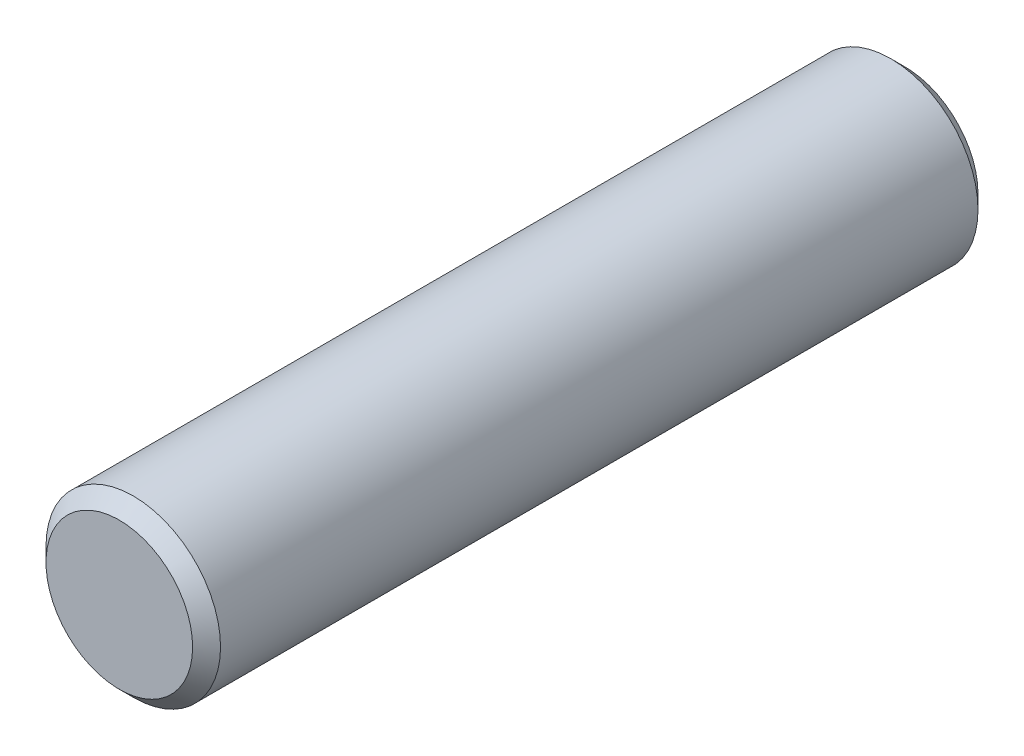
from build123d import *


with BuildPart() as part:
    # Sketch 1 → Revolve 1 (revolve)
    with BuildSketch(Plane(origin=(0, 0, 0), x_dir=(0, 0, -1), z_dir=(1, 0, 0)), mode=Mode.PRIVATE) as revolve_1_sk:
        Polygon((-6.88975, 1.5875), (-7.14375, 1.3335), (-7.14375, 0), (7.14375, 0), (7.14375, 1.3335), (6.88975, 1.5875), align=None)
    revolve(revolve_1_sk.sketch.rotate(Axis((0, 0, 32.274285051), (0, 0, -1)), 90), axis=Axis((0, 0, 32.274285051), (0, 0, -1)))


solid = part.part
